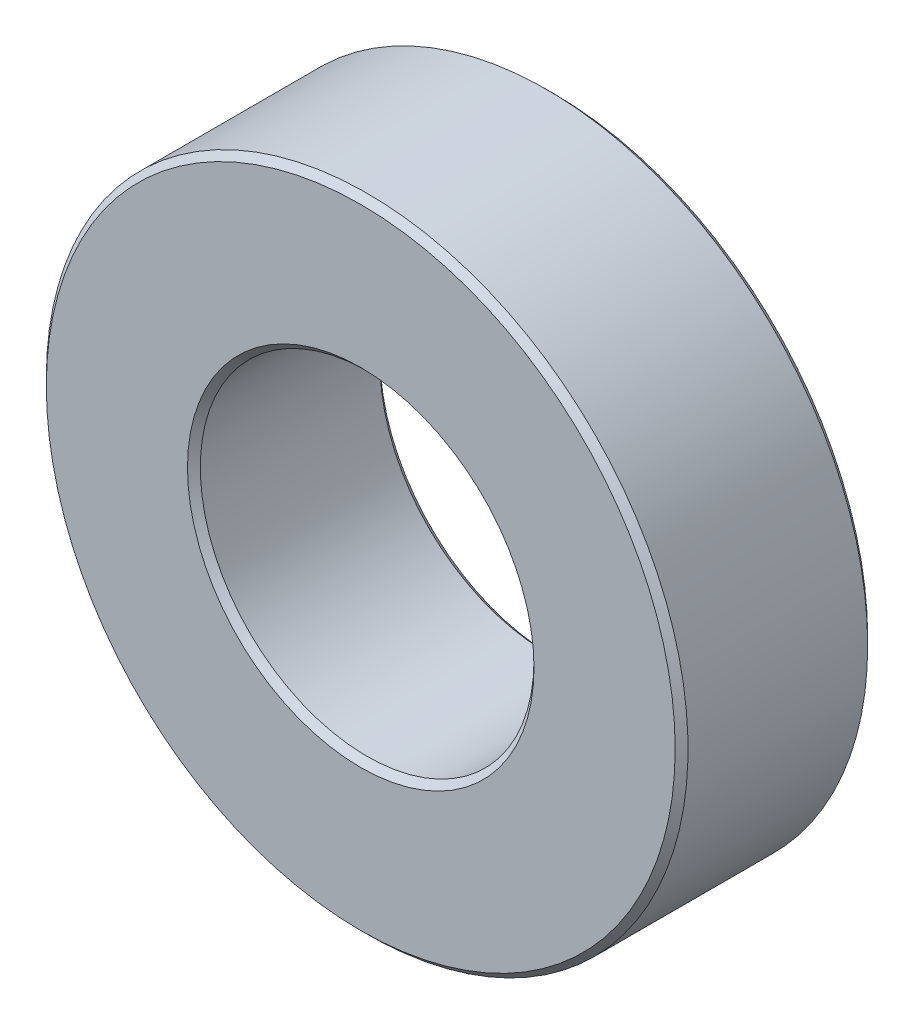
ISO-10303-21;
HEADER;
FILE_DESCRIPTION(('STEP AP214'),'2;1');
FILE_NAME('part.step','',(''),(''),'','','');
FILE_SCHEMA(('AUTOMOTIVE_DESIGN { 1 0 10303 214 1 1 1 1 }'));
ENDSEC;
DATA;
#1=APPLICATION_CONTEXT('core data for automotive mechanical design processes');
#2=APPLICATION_PROTOCOL_DEFINITION('international standard','automotive_design',2000,#1);
#3=PRODUCT_CONTEXT('',#1,'mechanical');
#4=PRODUCT('Part','Part','',(#3));
#5=PRODUCT_RELATED_PRODUCT_CATEGORY('part','',(#4));
#6=PRODUCT_DEFINITION_FORMATION('','',#4);
#7=PRODUCT_DEFINITION_CONTEXT('part definition',#1,'design');
#8=PRODUCT_DEFINITION('design','',#6,#7);
#9=PRODUCT_DEFINITION_SHAPE('','',#8);
#10=(LENGTH_UNIT() NAMED_UNIT(*) SI_UNIT(.MILLI.,.METRE.));
#11=(NAMED_UNIT(*) PLANE_ANGLE_UNIT() SI_UNIT($,.RADIAN.));
#12=(NAMED_UNIT(*) SI_UNIT($,.STERADIAN.) SOLID_ANGLE_UNIT());
#13=UNCERTAINTY_MEASURE_WITH_UNIT(LENGTH_MEASURE(1.E-05),#10,'distance_accuracy_value','');
#14=(GEOMETRIC_REPRESENTATION_CONTEXT(3) GLOBAL_UNCERTAINTY_ASSIGNED_CONTEXT((#13)) GLOBAL_UNIT_ASSIGNED_CONTEXT((#10,
#11,#12)) REPRESENTATION_CONTEXT('',''));
#15=CARTESIAN_POINT('',(0.,0.,0.));
#16=DIRECTION('',(0.,0.,1.));
#17=DIRECTION('',(1.,0.,0.));
#18=AXIS2_PLACEMENT_3D('',#15,#16,#17);
#19=CARTESIAN_POINT('',(0.,0.,1.5));
#20=DIRECTION('',(0.,0.,1.));
#21=DIRECTION('',(1.,0.,0.));
#22=AXIS2_PLACEMENT_3D('',#19,#20,#21);
#23=PLANE('',#22);
#24=CARTESIAN_POINT('',(0.,0.,1.5));
#25=DIRECTION('',(0.,0.,1.));
#26=DIRECTION('',(1.,0.,0.));
#27=AXIS2_PLACEMENT_3D('',#24,#25,#26);
#28=CIRCLE('',#27,2.7);
#29=CARTESIAN_POINT('',(2.7,0.,1.5));
#30=VERTEX_POINT('',#29);
#31=EDGE_CURVE('E10',#30,#30,#28,.F.);
#32=ORIENTED_EDGE('',*,*,#31,.T.);
#33=EDGE_LOOP('',(#32));
#34=FACE_BOUND('',#33,.T.);
#35=CARTESIAN_POINT('',(0.,0.,1.5));
#36=DIRECTION('',(0.,0.,1.));
#37=DIRECTION('',(1.,0.,0.));
#38=AXIS2_PLACEMENT_3D('',#35,#36,#37);
#39=CIRCLE('',#38,4.9);
#40=CARTESIAN_POINT('',(-4.9,0.,1.5));
#41=VERTEX_POINT('',#40);
#42=EDGE_CURVE('E45',#41,#41,#39,.T.);
#43=ORIENTED_EDGE('',*,*,#42,.T.);
#44=EDGE_LOOP('',(#43));
#45=FACE_BOUND('',#44,.T.);
#46=ADVANCED_FACE('F37',(#34,#45),#23,.T.);
#47=CARTESIAN_POINT('',(0.,0.,-1.5));
#48=DIRECTION('',(0.,0.,1.));
#49=DIRECTION('',(1.,0.,0.));
#50=AXIS2_PLACEMENT_3D('',#47,#48,#49);
#51=PLANE('',#50);
#52=CARTESIAN_POINT('',(0.,0.,-1.5));
#53=DIRECTION('',(0.,0.,1.));
#54=DIRECTION('',(1.,0.,0.));
#55=AXIS2_PLACEMENT_3D('',#52,#53,#54);
#56=CIRCLE('',#55,4.9);
#57=CARTESIAN_POINT('',(4.9,0.,-1.5));
#58=VERTEX_POINT('',#57);
#59=EDGE_CURVE('E63',#58,#58,#56,.F.);
#60=ORIENTED_EDGE('',*,*,#59,.T.);
#61=EDGE_LOOP('',(#60));
#62=FACE_BOUND('',#61,.T.);
#63=CARTESIAN_POINT('',(0.,0.,-1.5));
#64=DIRECTION('',(0.,0.,1.));
#65=DIRECTION('',(1.,0.,0.));
#66=AXIS2_PLACEMENT_3D('',#63,#64,#65);
#67=CIRCLE('',#66,2.7);
#68=CARTESIAN_POINT('',(2.7,0.,-1.5));
#69=VERTEX_POINT('',#68);
#70=EDGE_CURVE('E66',#69,#69,#67,.T.);
#71=ORIENTED_EDGE('',*,*,#70,.T.);
#72=EDGE_LOOP('',(#71));
#73=FACE_BOUND('',#72,.T.);
#74=ADVANCED_FACE('F89',(#62,#73),#51,.F.);
#75=CARTESIAN_POINT('',(0.,0.,1.5));
#76=DIRECTION('',(0.,0.,-1.));
#77=DIRECTION('',(-1.,0.,0.));
#78=AXIS2_PLACEMENT_3D('',#75,#76,#77);
#79=CYLINDRICAL_SURFACE('',#78,5.);
#80=CARTESIAN_POINT('',(0.,0.,-1.4));
#81=DIRECTION('',(0.,0.,1.));
#82=DIRECTION('',(1.,0.,0.));
#83=AXIS2_PLACEMENT_3D('',#80,#81,#82);
#84=CIRCLE('',#83,5.);
#85=CARTESIAN_POINT('',(5.,0.,-1.4));
#86=VERTEX_POINT('',#85);
#87=EDGE_CURVE('E70',#86,#86,#84,.T.);
#88=ORIENTED_EDGE('',*,*,#87,.T.);
#89=EDGE_LOOP('',(#88));
#90=FACE_BOUND('',#89,.T.);
#91=CARTESIAN_POINT('',(0.,0.,1.4));
#92=DIRECTION('',(0.,0.,1.));
#93=DIRECTION('',(1.,0.,0.));
#94=AXIS2_PLACEMENT_3D('',#91,#92,#93);
#95=CIRCLE('',#94,5.);
#96=CARTESIAN_POINT('',(-5.,0.,1.4));
#97=VERTEX_POINT('',#96);
#98=EDGE_CURVE('E74',#97,#97,#95,.F.);
#99=ORIENTED_EDGE('',*,*,#98,.T.);
#100=EDGE_LOOP('',(#99));
#101=FACE_BOUND('',#100,.T.);
#102=ADVANCED_FACE('F78',(#90,#101),#79,.T.);
#103=CARTESIAN_POINT('',(0.,0.,1.5));
#104=DIRECTION('',(0.,0.,-1.));
#105=DIRECTION('',(-1.,0.,0.));
#106=AXIS2_PLACEMENT_3D('',#103,#104,#105);
#107=CYLINDRICAL_SURFACE('',#106,2.6);
#108=CARTESIAN_POINT('',(0.,0.,-1.4));
#109=DIRECTION('',(0.,0.,1.));
#110=DIRECTION('',(1.,0.,0.));
#111=AXIS2_PLACEMENT_3D('',#108,#109,#110);
#112=CIRCLE('',#111,2.6);
#113=CARTESIAN_POINT('',(2.6,0.,-1.4));
#114=VERTEX_POINT('',#113);
#115=EDGE_CURVE('E52',#114,#114,#112,.F.);
#116=ORIENTED_EDGE('',*,*,#115,.T.);
#117=EDGE_LOOP('',(#116));
#118=FACE_BOUND('',#117,.T.);
#119=CARTESIAN_POINT('',(0.,0.,1.4));
#120=DIRECTION('',(0.,0.,1.));
#121=DIRECTION('',(1.,0.,0.));
#122=AXIS2_PLACEMENT_3D('',#119,#120,#121);
#123=CIRCLE('',#122,2.6);
#124=CARTESIAN_POINT('',(2.6,0.,1.4));
#125=VERTEX_POINT('',#124);
#126=EDGE_CURVE('E58',#125,#125,#123,.T.);
#127=ORIENTED_EDGE('',*,*,#126,.T.);
#128=EDGE_LOOP('',(#127));
#129=FACE_BOUND('',#128,.T.);
#130=ADVANCED_FACE('F97',(#118,#129),#107,.F.);
#131=CARTESIAN_POINT('',(0.,0.,-1.4));
#132=DIRECTION('',(0.,0.,1.));
#133=DIRECTION('',(1.,0.,0.));
#134=AXIS2_PLACEMENT_3D('',#131,#132,#133);
#135=CONICAL_SURFACE('',#134,5.,0.785398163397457);
#136=ORIENTED_EDGE('',*,*,#59,.F.);
#137=EDGE_LOOP('',(#136));
#138=FACE_BOUND('',#137,.T.);
#139=ORIENTED_EDGE('',*,*,#87,.F.);
#140=EDGE_LOOP('',(#139));
#141=FACE_BOUND('',#140,.T.);
#142=ADVANCED_FACE('F102',(#138,#141),#135,.T.);
#143=CARTESIAN_POINT('',(0.,0.,-1.5));
#144=DIRECTION('',(0.,0.,-1.));
#145=DIRECTION('',(-1.,0.,0.));
#146=AXIS2_PLACEMENT_3D('',#143,#144,#145);
#147=CONICAL_SURFACE('',#146,2.7,0.785398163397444);
#148=ORIENTED_EDGE('',*,*,#115,.F.);
#149=EDGE_LOOP('',(#148));
#150=FACE_BOUND('',#149,.T.);
#151=ORIENTED_EDGE('',*,*,#70,.F.);
#152=EDGE_LOOP('',(#151));
#153=FACE_BOUND('',#152,.T.);
#154=ADVANCED_FACE('F86',(#150,#153),#147,.F.);
#155=CARTESIAN_POINT('',(0.,0.,1.4));
#156=DIRECTION('',(0.,0.,1.));
#157=DIRECTION('',(1.,0.,0.));
#158=AXIS2_PLACEMENT_3D('',#155,#156,#157);
#159=CONICAL_SURFACE('',#158,2.6,0.785398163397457);
#160=ORIENTED_EDGE('',*,*,#31,.F.);
#161=EDGE_LOOP('',(#160));
#162=FACE_BOUND('',#161,.T.);
#163=ORIENTED_EDGE('',*,*,#126,.F.);
#164=EDGE_LOOP('',(#163));
#165=FACE_BOUND('',#164,.T.);
#166=ADVANCED_FACE('F82',(#162,#165),#159,.F.);
#167=CARTESIAN_POINT('',(0.,0.,1.5));
#168=DIRECTION('',(0.,0.,-1.));
#169=DIRECTION('',(-1.,0.,0.));
#170=AXIS2_PLACEMENT_3D('',#167,#168,#169);
#171=CONICAL_SURFACE('',#170,4.9,0.785398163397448);
#172=CARTESIAN_POINT('',(-5.,0.,1.4));
#173=CARTESIAN_POINT('',(-4.99895833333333,0.,1.40104166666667));
#174=CARTESIAN_POINT('',(-4.99791666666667,0.,1.40208333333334));
#175=CARTESIAN_POINT('',(-4.99583333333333,0.,1.40416666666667));
#176=CARTESIAN_POINT('',(-4.99479166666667,0.,1.40520833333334));
#177=CARTESIAN_POINT('',(-4.99270833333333,0.,1.40729166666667));
#178=CARTESIAN_POINT('',(-4.99166666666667,0.,1.40833333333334));
#179=CARTESIAN_POINT('',(-4.98958333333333,0.,1.41041666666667));
#180=CARTESIAN_POINT('',(-4.98854166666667,0.,1.41145833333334));
#181=CARTESIAN_POINT('',(-4.98645833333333,0.,1.41354166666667));
#182=CARTESIAN_POINT('',(-4.98541666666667,0.,1.41458333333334));
#183=CARTESIAN_POINT('',(-4.98333333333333,0.,1.41666666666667));
#184=CARTESIAN_POINT('',(-4.98229166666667,0.,1.41770833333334));
#185=CARTESIAN_POINT('',(-4.98020833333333,0.,1.41979166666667));
#186=CARTESIAN_POINT('',(-4.97916666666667,0.,1.42083333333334));
#187=CARTESIAN_POINT('',(-4.97708333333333,0.,1.42291666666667));
#188=CARTESIAN_POINT('',(-4.97604166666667,0.,1.42395833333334));
#189=CARTESIAN_POINT('',(-4.97395833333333,0.,1.42604166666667));
#190=CARTESIAN_POINT('',(-4.97291666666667,0.,1.42708333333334));
#191=CARTESIAN_POINT('',(-4.97083333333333,0.,1.42916666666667));
#192=CARTESIAN_POINT('',(-4.96979166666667,0.,1.43020833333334));
#193=CARTESIAN_POINT('',(-4.96770833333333,0.,1.43229166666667));
#194=CARTESIAN_POINT('',(-4.96666666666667,0.,1.43333333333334));
#195=CARTESIAN_POINT('',(-4.96458333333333,0.,1.43541666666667));
#196=CARTESIAN_POINT('',(-4.96354166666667,0.,1.43645833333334));
#197=CARTESIAN_POINT('',(-4.96145833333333,0.,1.43854166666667));
#198=CARTESIAN_POINT('',(-4.96041666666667,0.,1.43958333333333));
#199=CARTESIAN_POINT('',(-4.95833333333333,0.,1.44166666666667));
#200=CARTESIAN_POINT('',(-4.95729166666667,0.,1.44270833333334));
#201=CARTESIAN_POINT('',(-4.95520833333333,0.,1.44479166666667));
#202=CARTESIAN_POINT('',(-4.95416666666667,0.,1.44583333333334));
#203=CARTESIAN_POINT('',(-4.95208333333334,0.,1.44791666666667));
#204=CARTESIAN_POINT('',(-4.95104166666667,0.,1.44895833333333));
#205=CARTESIAN_POINT('',(-4.94895833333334,0.,1.45104166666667));
#206=CARTESIAN_POINT('',(-4.94791666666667,0.,1.45208333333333));
#207=CARTESIAN_POINT('',(-4.94583333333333,0.,1.45416666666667));
#208=CARTESIAN_POINT('',(-4.94479166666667,0.,1.45520833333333));
#209=CARTESIAN_POINT('',(-4.94270833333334,0.,1.45729166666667));
#210=CARTESIAN_POINT('',(-4.94166666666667,0.,1.45833333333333));
#211=CARTESIAN_POINT('',(-4.93958333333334,0.,1.46041666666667));
#212=CARTESIAN_POINT('',(-4.93854166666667,0.,1.46145833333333));
#213=CARTESIAN_POINT('',(-4.93645833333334,0.,1.46354166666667));
#214=CARTESIAN_POINT('',(-4.93541666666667,0.,1.46458333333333));
#215=CARTESIAN_POINT('',(-4.93333333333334,0.,1.46666666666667));
#216=CARTESIAN_POINT('',(-4.93229166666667,0.,1.46770833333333));
#217=CARTESIAN_POINT('',(-4.93020833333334,0.,1.46979166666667));
#218=CARTESIAN_POINT('',(-4.92916666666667,0.,1.47083333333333));
#219=CARTESIAN_POINT('',(-4.92708333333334,0.,1.47291666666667));
#220=CARTESIAN_POINT('',(-4.92604166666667,0.,1.47395833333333));
#221=CARTESIAN_POINT('',(-4.92395833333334,0.,1.47604166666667));
#222=CARTESIAN_POINT('',(-4.92291666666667,0.,1.47708333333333));
#223=CARTESIAN_POINT('',(-4.92083333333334,0.,1.47916666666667));
#224=CARTESIAN_POINT('',(-4.91979166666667,0.,1.48020833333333));
#225=CARTESIAN_POINT('',(-4.91770833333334,0.,1.48229166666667));
#226=CARTESIAN_POINT('',(-4.91666666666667,0.,1.48333333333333));
#227=CARTESIAN_POINT('',(-4.91458333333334,0.,1.48541666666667));
#228=CARTESIAN_POINT('',(-4.91354166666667,0.,1.48645833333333));
#229=CARTESIAN_POINT('',(-4.91145833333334,0.,1.48854166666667));
#230=CARTESIAN_POINT('',(-4.91041666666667,0.,1.48958333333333));
#231=CARTESIAN_POINT('',(-4.90833333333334,0.,1.49166666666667));
#232=CARTESIAN_POINT('',(-4.90729166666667,0.,1.49270833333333));
#233=CARTESIAN_POINT('',(-4.90520833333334,0.,1.49479166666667));
#234=CARTESIAN_POINT('',(-4.90416666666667,0.,1.49583333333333));
#235=CARTESIAN_POINT('',(-4.90208333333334,0.,1.49791666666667));
#236=CARTESIAN_POINT('',(-4.90104166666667,0.,1.49895833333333));
#237=CARTESIAN_POINT('',(-4.9,0.,1.5));
#238=B_SPLINE_CURVE_WITH_KNOTS('',3,(#172,#173,#174,#175,#176,#177,#178,#179,#180,#181,#182,
#183,#184,#185,#186,#187,#188,#189,#190,#191,#192,#193,#194,#195,#196,#197,#198,#199,#200,#201,
#202,#203,#204,#205,#206,#207,#208,#209,#210,#211,#212,#213,#214,#215,#216,#217,#218,#219,#220,
#221,#222,#223,#224,#225,#226,#227,#228,#229,#230,#231,#232,#233,#234,#235,#236,#237),
.UNSPECIFIED.,.F.,.F.,(4,2,2,2,2,2,2,2,2,2,2,2,2,2,2,2,2,2,2,2,2,2,2,2,2,2,2,2,2,2,2,2,4),(0.,
0.00441941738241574,0.00883883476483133,0.0132582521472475,0.0176776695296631,
0.0220970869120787,0.0265165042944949,0.0309359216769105,0.0353553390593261,0.0397747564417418,
0.044194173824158,0.0486135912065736,0.0530330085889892,0.0574524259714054,0.061871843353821,
0.0662912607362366,0.0707106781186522,0.0751300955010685,0.0795495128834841,0.0839689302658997,
0.0883883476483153,0.0928077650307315,0.0972271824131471,0.101646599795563,0.106066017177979,
0.110485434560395,0.11490485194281,0.119324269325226,0.123743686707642,0.128163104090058,
0.132582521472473,0.137001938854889,0.141421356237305),.UNSPECIFIED.);
#239=EDGE_CURVE('BSEAM39',#97,#41,#238,.T.);
#240=ORIENTED_EDGE('',*,*,#98,.F.);
#241=ORIENTED_EDGE('',*,*,#42,.F.);
#242=ORIENTED_EDGE('',*,*,#239,.T.);
#243=ORIENTED_EDGE('',*,*,#239,.F.);
#244=EDGE_LOOP('',(#240,#242,#241,#243));
#245=FACE_BOUND('',#244,.T.);
#246=ADVANCED_FACE('F39',(#245),#171,.T.);
#247=CLOSED_SHELL('',(#46,#74,#102,#130,#142,#154,#166,#246));
#248=MANIFOLD_SOLID_BREP('B2',#247);
#249=ADVANCED_BREP_SHAPE_REPRESENTATION('',(#18,#248),#14);
#250=SHAPE_DEFINITION_REPRESENTATION(#9,#249);
ENDSEC;
END-ISO-10303-21;
